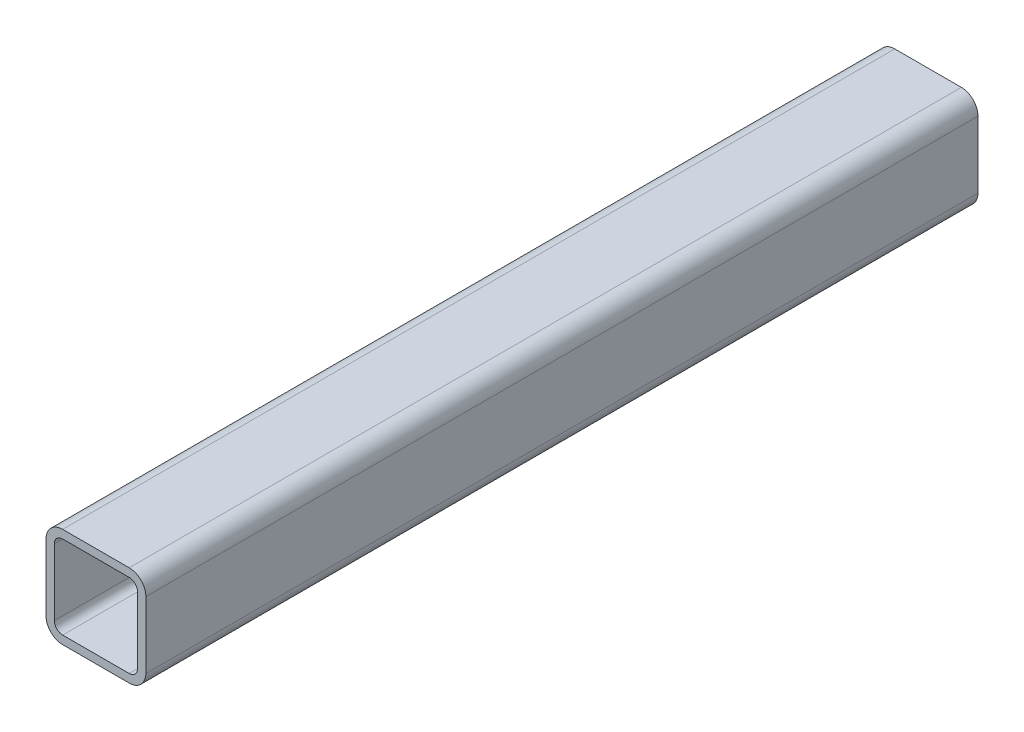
ISO-10303-21;
HEADER;
FILE_DESCRIPTION(('STEP AP214'),'2;1');
FILE_NAME('part.step','',(''),(''),'','','');
FILE_SCHEMA(('AUTOMOTIVE_DESIGN { 1 0 10303 214 1 1 1 1 }'));
ENDSEC;
DATA;
#1=APPLICATION_CONTEXT('core data for automotive mechanical design processes');
#2=APPLICATION_PROTOCOL_DEFINITION('international standard','automotive_design',2000,#1);
#3=PRODUCT_CONTEXT('',#1,'mechanical');
#4=PRODUCT('Part','Part','',(#3));
#5=PRODUCT_RELATED_PRODUCT_CATEGORY('part','',(#4));
#6=PRODUCT_DEFINITION_FORMATION('','',#4);
#7=PRODUCT_DEFINITION_CONTEXT('part definition',#1,'design');
#8=PRODUCT_DEFINITION('design','',#6,#7);
#9=PRODUCT_DEFINITION_SHAPE('','',#8);
#10=(LENGTH_UNIT() NAMED_UNIT(*) SI_UNIT(.MILLI.,.METRE.));
#11=(NAMED_UNIT(*) PLANE_ANGLE_UNIT() SI_UNIT($,.RADIAN.));
#12=(NAMED_UNIT(*) SI_UNIT($,.STERADIAN.) SOLID_ANGLE_UNIT());
#13=UNCERTAINTY_MEASURE_WITH_UNIT(LENGTH_MEASURE(1.E-05),#10,'distance_accuracy_value','');
#14=(GEOMETRIC_REPRESENTATION_CONTEXT(3) GLOBAL_UNCERTAINTY_ASSIGNED_CONTEXT((#13)) GLOBAL_UNIT_ASSIGNED_CONTEXT((#10,
#11,#12)) REPRESENTATION_CONTEXT('',''));
#15=CARTESIAN_POINT('',(0.,0.,0.));
#16=DIRECTION('',(0.,0.,1.));
#17=DIRECTION('',(1.,0.,0.));
#18=AXIS2_PLACEMENT_3D('',#15,#16,#17);
#19=CARTESIAN_POINT('',(-25.4,25.4,635.));
#20=DIRECTION('',(0.,0.,-1.));
#21=DIRECTION('',(-1.,0.,0.));
#22=AXIS2_PLACEMENT_3D('',#19,#20,#21);
#23=CYLINDRICAL_SURFACE('',#22,12.7);
#24=CARTESIAN_POINT('',(-25.4,25.4,0.));
#25=DIRECTION('',(0.,0.,-1.));
#26=DIRECTION('',(-1.,0.,0.));
#27=AXIS2_PLACEMENT_3D('',#24,#25,#26);
#28=CIRCLE('',#27,12.7);
#29=CARTESIAN_POINT('',(-38.1,25.4,0.));
#30=VERTEX_POINT('',#29);
#31=CARTESIAN_POINT('',(-25.4,38.1,0.));
#32=VERTEX_POINT('',#31);
#33=EDGE_CURVE('E199',#30,#32,#28,.T.);
#34=ORIENTED_EDGE('',*,*,#33,.F.);
#35=DIRECTION('',(0.,0.,-1.));
#36=VECTOR('',#35,1.);
#37=CARTESIAN_POINT('',(-38.1,25.4,635.));
#38=LINE('',#37,#36);
#39=CARTESIAN_POINT('',(-38.1,25.4,635.));
#40=VERTEX_POINT('',#39);
#41=EDGE_CURVE('E11',#40,#30,#38,.T.);
#42=ORIENTED_EDGE('',*,*,#41,.F.);
#43=CARTESIAN_POINT('',(-25.4,25.4,635.));
#44=DIRECTION('',(0.,0.,-1.));
#45=DIRECTION('',(-1.,0.,0.));
#46=AXIS2_PLACEMENT_3D('',#43,#44,#45);
#47=CIRCLE('',#46,12.7);
#48=CARTESIAN_POINT('',(-25.4,38.1,635.));
#49=VERTEX_POINT('',#48);
#50=EDGE_CURVE('E211',#40,#49,#47,.T.);
#51=ORIENTED_EDGE('',*,*,#50,.T.);
#52=DIRECTION('',(0.,0.,-1.));
#53=VECTOR('',#52,1.);
#54=CARTESIAN_POINT('',(-25.4,38.1,635.));
#55=LINE('',#54,#53);
#56=EDGE_CURVE('E35',#49,#32,#55,.T.);
#57=ORIENTED_EDGE('',*,*,#56,.T.);
#58=EDGE_LOOP('',(#34,#42,#51,#57));
#59=FACE_BOUND('',#58,.T.);
#60=ADVANCED_FACE('F32',(#59),#23,.T.);
#61=CARTESIAN_POINT('',(-38.1,25.4,635.));
#62=DIRECTION('',(1.,0.,0.));
#63=DIRECTION('',(0.,1.,0.));
#64=AXIS2_PLACEMENT_3D('',#61,#62,#63);
#65=PLANE('',#64);
#66=DIRECTION('',(0.,-1.,0.));
#67=VECTOR('',#66,1.);
#68=CARTESIAN_POINT('',(-38.1,25.4,0.));
#69=LINE('',#68,#67);
#70=CARTESIAN_POINT('',(-38.1,-25.4,0.));
#71=VERTEX_POINT('',#70);
#72=EDGE_CURVE('E215',#30,#71,#69,.T.);
#73=ORIENTED_EDGE('',*,*,#72,.T.);
#74=DIRECTION('',(0.,0.,-1.));
#75=VECTOR('',#74,1.);
#76=CARTESIAN_POINT('',(-38.1,-25.4,635.));
#77=LINE('',#76,#75);
#78=CARTESIAN_POINT('',(-38.1,-25.4,635.));
#79=VERTEX_POINT('',#78);
#80=EDGE_CURVE('E40',#79,#71,#77,.T.);
#81=ORIENTED_EDGE('',*,*,#80,.F.);
#82=DIRECTION('',(0.,-1.,0.));
#83=VECTOR('',#82,1.);
#84=CARTESIAN_POINT('',(-38.1,25.4,635.));
#85=LINE('',#84,#83);
#86=EDGE_CURVE('E231',#40,#79,#85,.T.);
#87=ORIENTED_EDGE('',*,*,#86,.F.);
#88=ORIENTED_EDGE('',*,*,#41,.T.);
#89=EDGE_LOOP('',(#73,#81,#87,#88));
#90=FACE_BOUND('',#89,.T.);
#91=ADVANCED_FACE('F279',(#90),#65,.F.);
#92=CARTESIAN_POINT('',(-25.4,-25.4,635.));
#93=DIRECTION('',(0.,0.,-1.));
#94=DIRECTION('',(-1.,0.,0.));
#95=AXIS2_PLACEMENT_3D('',#92,#93,#94);
#96=CYLINDRICAL_SURFACE('',#95,12.7);
#97=CARTESIAN_POINT('',(-25.4,-25.4,0.));
#98=DIRECTION('',(0.,0.,-1.));
#99=DIRECTION('',(-1.,0.,0.));
#100=AXIS2_PLACEMENT_3D('',#97,#98,#99);
#101=CIRCLE('',#100,12.7);
#102=CARTESIAN_POINT('',(-25.4,-38.1,0.));
#103=VERTEX_POINT('',#102);
#104=EDGE_CURVE('E249',#103,#71,#101,.T.);
#105=ORIENTED_EDGE('',*,*,#104,.F.);
#106=DIRECTION('',(0.,0.,-1.));
#107=VECTOR('',#106,1.);
#108=CARTESIAN_POINT('',(-25.4,-38.1,635.));
#109=LINE('',#108,#107);
#110=CARTESIAN_POINT('',(-25.4,-38.1,635.));
#111=VERTEX_POINT('',#110);
#112=EDGE_CURVE('E255',#111,#103,#109,.T.);
#113=ORIENTED_EDGE('',*,*,#112,.F.);
#114=CARTESIAN_POINT('',(-25.4,-25.4,635.));
#115=DIRECTION('',(0.,0.,-1.));
#116=DIRECTION('',(-1.,0.,0.));
#117=AXIS2_PLACEMENT_3D('',#114,#115,#116);
#118=CIRCLE('',#117,12.7);
#119=EDGE_CURVE('E228',#111,#79,#118,.T.);
#120=ORIENTED_EDGE('',*,*,#119,.T.);
#121=ORIENTED_EDGE('',*,*,#80,.T.);
#122=EDGE_LOOP('',(#105,#113,#120,#121));
#123=FACE_BOUND('',#122,.T.);
#124=ADVANCED_FACE('F298',(#123),#96,.T.);
#125=CARTESIAN_POINT('',(25.4,-38.1,635.));
#126=DIRECTION('',(0.,-1.,0.));
#127=DIRECTION('',(0.,0.,-1.));
#128=AXIS2_PLACEMENT_3D('',#125,#126,#127);
#129=PLANE('',#128);
#130=DIRECTION('',(-1.,0.,0.));
#131=VECTOR('',#130,1.);
#132=CARTESIAN_POINT('',(25.4,-38.1,0.));
#133=LINE('',#132,#131);
#134=CARTESIAN_POINT('',(25.4,-38.1,0.));
#135=VERTEX_POINT('',#134);
#136=EDGE_CURVE('E246',#135,#103,#133,.T.);
#137=ORIENTED_EDGE('',*,*,#136,.F.);
#138=DIRECTION('',(0.,0.,-1.));
#139=VECTOR('',#138,1.);
#140=CARTESIAN_POINT('',(25.4,-38.1,635.));
#141=LINE('',#140,#139);
#142=CARTESIAN_POINT('',(25.4,-38.1,635.));
#143=VERTEX_POINT('',#142);
#144=EDGE_CURVE('E257',#143,#135,#141,.T.);
#145=ORIENTED_EDGE('',*,*,#144,.F.);
#146=DIRECTION('',(-1.,0.,0.));
#147=VECTOR('',#146,1.);
#148=CARTESIAN_POINT('',(25.4,-38.1,635.));
#149=LINE('',#148,#147);
#150=EDGE_CURVE('E225',#143,#111,#149,.T.);
#151=ORIENTED_EDGE('',*,*,#150,.T.);
#152=ORIENTED_EDGE('',*,*,#112,.T.);
#153=EDGE_LOOP('',(#137,#145,#151,#152));
#154=FACE_BOUND('',#153,.T.);
#155=ADVANCED_FACE('F296',(#154),#129,.T.);
#156=CARTESIAN_POINT('',(25.4,-25.4,635.));
#157=DIRECTION('',(0.,0.,-1.));
#158=DIRECTION('',(-1.,0.,0.));
#159=AXIS2_PLACEMENT_3D('',#156,#157,#158);
#160=CYLINDRICAL_SURFACE('',#159,12.7);
#161=CARTESIAN_POINT('',(25.4,-25.4,0.));
#162=DIRECTION('',(0.,0.,-1.));
#163=DIRECTION('',(-1.,0.,0.));
#164=AXIS2_PLACEMENT_3D('',#161,#162,#163);
#165=CIRCLE('',#164,12.7);
#166=CARTESIAN_POINT('',(38.1,-25.4,0.));
#167=VERTEX_POINT('',#166);
#168=EDGE_CURVE('E243',#167,#135,#165,.T.);
#169=ORIENTED_EDGE('',*,*,#168,.F.);
#170=DIRECTION('',(0.,0.,-1.));
#171=VECTOR('',#170,1.);
#172=CARTESIAN_POINT('',(38.1,-25.4,635.));
#173=LINE('',#172,#171);
#174=CARTESIAN_POINT('',(38.1,-25.4,635.));
#175=VERTEX_POINT('',#174);
#176=EDGE_CURVE('E259',#175,#167,#173,.T.);
#177=ORIENTED_EDGE('',*,*,#176,.F.);
#178=CARTESIAN_POINT('',(25.4,-25.4,635.));
#179=DIRECTION('',(0.,0.,-1.));
#180=DIRECTION('',(-1.,0.,0.));
#181=AXIS2_PLACEMENT_3D('',#178,#179,#180);
#182=CIRCLE('',#181,12.7);
#183=EDGE_CURVE('E222',#175,#143,#182,.T.);
#184=ORIENTED_EDGE('',*,*,#183,.T.);
#185=ORIENTED_EDGE('',*,*,#144,.T.);
#186=EDGE_LOOP('',(#169,#177,#184,#185));
#187=FACE_BOUND('',#186,.T.);
#188=ADVANCED_FACE('F292',(#187),#160,.T.);
#189=CARTESIAN_POINT('',(38.1,-25.4,635.));
#190=DIRECTION('',(-1.,0.,0.));
#191=DIRECTION('',(0.,0.,1.));
#192=AXIS2_PLACEMENT_3D('',#189,#190,#191);
#193=PLANE('',#192);
#194=DIRECTION('',(0.,1.,0.));
#195=VECTOR('',#194,1.);
#196=CARTESIAN_POINT('',(38.1,-25.4,0.));
#197=LINE('',#196,#195);
#198=CARTESIAN_POINT('',(38.1,25.4,0.));
#199=VERTEX_POINT('',#198);
#200=EDGE_CURVE('E241',#167,#199,#197,.T.);
#201=ORIENTED_EDGE('',*,*,#200,.T.);
#202=DIRECTION('',(0.,0.,-1.));
#203=VECTOR('',#202,1.);
#204=CARTESIAN_POINT('',(38.1,25.4,635.));
#205=LINE('',#204,#203);
#206=CARTESIAN_POINT('',(38.1,25.4,635.));
#207=VERTEX_POINT('',#206);
#208=EDGE_CURVE('E261',#207,#199,#205,.T.);
#209=ORIENTED_EDGE('',*,*,#208,.F.);
#210=DIRECTION('',(0.,1.,0.));
#211=VECTOR('',#210,1.);
#212=CARTESIAN_POINT('',(38.1,-25.4,635.));
#213=LINE('',#212,#211);
#214=EDGE_CURVE('E220',#175,#207,#213,.T.);
#215=ORIENTED_EDGE('',*,*,#214,.F.);
#216=ORIENTED_EDGE('',*,*,#176,.T.);
#217=EDGE_LOOP('',(#201,#209,#215,#216));
#218=FACE_BOUND('',#217,.T.);
#219=ADVANCED_FACE('F333',(#218),#193,.F.);
#220=CARTESIAN_POINT('',(25.4,25.4,635.));
#221=DIRECTION('',(0.,0.,-1.));
#222=DIRECTION('',(-1.,0.,0.));
#223=AXIS2_PLACEMENT_3D('',#220,#221,#222);
#224=CYLINDRICAL_SURFACE('',#223,12.7);
#225=CARTESIAN_POINT('',(25.4,25.4,0.));
#226=DIRECTION('',(0.,0.,1.));
#227=DIRECTION('',(1.,0.,0.));
#228=AXIS2_PLACEMENT_3D('',#225,#226,#227);
#229=CIRCLE('',#228,12.7);
#230=CARTESIAN_POINT('',(25.4,38.1,0.));
#231=VERTEX_POINT('',#230);
#232=EDGE_CURVE('E238',#199,#231,#229,.T.);
#233=ORIENTED_EDGE('',*,*,#232,.T.);
#234=DIRECTION('',(0.,0.,-1.));
#235=VECTOR('',#234,1.);
#236=CARTESIAN_POINT('',(25.4,38.1,635.));
#237=LINE('',#236,#235);
#238=CARTESIAN_POINT('',(25.4,38.1,635.));
#239=VERTEX_POINT('',#238);
#240=EDGE_CURVE('E263',#239,#231,#237,.T.);
#241=ORIENTED_EDGE('',*,*,#240,.F.);
#242=CARTESIAN_POINT('',(25.4,25.4,635.));
#243=DIRECTION('',(0.,0.,1.));
#244=DIRECTION('',(1.,0.,0.));
#245=AXIS2_PLACEMENT_3D('',#242,#243,#244);
#246=CIRCLE('',#245,12.7);
#247=EDGE_CURVE('E218',#207,#239,#246,.T.);
#248=ORIENTED_EDGE('',*,*,#247,.F.);
#249=ORIENTED_EDGE('',*,*,#208,.T.);
#250=EDGE_LOOP('',(#233,#241,#248,#249));
#251=FACE_BOUND('',#250,.T.);
#252=ADVANCED_FACE('F287',(#251),#224,.T.);
#253=CARTESIAN_POINT('',(-25.4,38.1,635.));
#254=DIRECTION('',(0.,1.,0.));
#255=DIRECTION('',(0.,0.,1.));
#256=AXIS2_PLACEMENT_3D('',#253,#254,#255);
#257=PLANE('',#256);
#258=DIRECTION('',(1.,0.,0.));
#259=VECTOR('',#258,1.);
#260=CARTESIAN_POINT('',(-25.4,38.1,0.));
#261=LINE('',#260,#259);
#262=EDGE_CURVE('E235',#32,#231,#261,.T.);
#263=ORIENTED_EDGE('',*,*,#262,.F.);
#264=ORIENTED_EDGE('',*,*,#56,.F.);
#265=DIRECTION('',(1.,0.,0.));
#266=VECTOR('',#265,1.);
#267=CARTESIAN_POINT('',(-25.4,38.1,635.));
#268=LINE('',#267,#266);
#269=EDGE_CURVE('E214',#49,#239,#268,.T.);
#270=ORIENTED_EDGE('',*,*,#269,.T.);
#271=ORIENTED_EDGE('',*,*,#240,.T.);
#272=EDGE_LOOP('',(#263,#264,#270,#271));
#273=FACE_BOUND('',#272,.T.);
#274=ADVANCED_FACE('F271',(#273),#257,.T.);
#275=CARTESIAN_POINT('',(-25.4,25.4,635.));
#276=DIRECTION('',(0.,0.,-1.));
#277=DIRECTION('',(-1.,0.,0.));
#278=AXIS2_PLACEMENT_3D('',#275,#276,#277);
#279=PLANE('',#278);
#280=DIRECTION('',(0.,-1.,0.));
#281=VECTOR('',#280,1.);
#282=CARTESIAN_POINT('',(-31.75,25.4,635.));
#283=LINE('',#282,#281);
#284=CARTESIAN_POINT('',(-31.75,25.4,635.));
#285=VERTEX_POINT('',#284);
#286=CARTESIAN_POINT('',(-31.75,-25.4,635.));
#287=VERTEX_POINT('',#286);
#288=EDGE_CURVE('E150',#285,#287,#283,.T.);
#289=ORIENTED_EDGE('',*,*,#288,.F.);
#290=CARTESIAN_POINT('',(-25.4,25.4,635.));
#291=DIRECTION('',(0.,0.,-1.));
#292=DIRECTION('',(-1.,0.,0.));
#293=AXIS2_PLACEMENT_3D('',#290,#291,#292);
#294=CIRCLE('',#293,6.35);
#295=CARTESIAN_POINT('',(-25.4,31.75,635.));
#296=VERTEX_POINT('',#295);
#297=EDGE_CURVE('E147',#285,#296,#294,.T.);
#298=ORIENTED_EDGE('',*,*,#297,.T.);
#299=DIRECTION('',(1.,0.,0.));
#300=VECTOR('',#299,1.);
#301=CARTESIAN_POINT('',(-25.4,31.75,635.));
#302=LINE('',#301,#300);
#303=CARTESIAN_POINT('',(25.4,31.75,635.));
#304=VERTEX_POINT('',#303);
#305=EDGE_CURVE('E153',#296,#304,#302,.T.);
#306=ORIENTED_EDGE('',*,*,#305,.T.);
#307=CARTESIAN_POINT('',(25.4,25.4,635.));
#308=DIRECTION('',(0.,0.,-1.));
#309=DIRECTION('',(-1.,0.,0.));
#310=AXIS2_PLACEMENT_3D('',#307,#308,#309);
#311=CIRCLE('',#310,6.35000000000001);
#312=CARTESIAN_POINT('',(31.75,25.4,635.));
#313=VERTEX_POINT('',#312);
#314=EDGE_CURVE('E157',#313,#304,#311,.F.);
#315=ORIENTED_EDGE('',*,*,#314,.F.);
#316=DIRECTION('',(0.,1.,0.));
#317=VECTOR('',#316,1.);
#318=CARTESIAN_POINT('',(31.75,25.4,635.));
#319=LINE('',#318,#317);
#320=CARTESIAN_POINT('',(31.75,-25.4,635.));
#321=VERTEX_POINT('',#320);
#322=EDGE_CURVE('E169',#321,#313,#319,.T.);
#323=ORIENTED_EDGE('',*,*,#322,.F.);
#324=CARTESIAN_POINT('',(25.4,-25.4,635.));
#325=DIRECTION('',(0.,0.,-1.));
#326=DIRECTION('',(-1.,0.,0.));
#327=AXIS2_PLACEMENT_3D('',#324,#325,#326);
#328=CIRCLE('',#327,6.35);
#329=CARTESIAN_POINT('',(25.4,-31.75,635.));
#330=VERTEX_POINT('',#329);
#331=EDGE_CURVE('E171',#321,#330,#328,.T.);
#332=ORIENTED_EDGE('',*,*,#331,.T.);
#333=DIRECTION('',(-1.,0.,0.));
#334=VECTOR('',#333,1.);
#335=CARTESIAN_POINT('',(-25.4,-31.75,635.));
#336=LINE('',#335,#334);
#337=CARTESIAN_POINT('',(-25.4,-31.75,635.));
#338=VERTEX_POINT('',#337);
#339=EDGE_CURVE('E174',#330,#338,#336,.T.);
#340=ORIENTED_EDGE('',*,*,#339,.T.);
#341=CARTESIAN_POINT('',(-25.4,-25.4,635.));
#342=DIRECTION('',(0.,0.,-1.));
#343=DIRECTION('',(-1.,0.,0.));
#344=AXIS2_PLACEMENT_3D('',#341,#342,#343);
#345=CIRCLE('',#344,6.35000000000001);
#346=EDGE_CURVE('E177',#338,#287,#345,.T.);
#347=ORIENTED_EDGE('',*,*,#346,.T.);
#348=EDGE_LOOP('',(#289,#298,#306,#315,#323,#332,#340,#347));
#349=FACE_BOUND('',#348,.T.);
#350=ORIENTED_EDGE('',*,*,#50,.F.);
#351=ORIENTED_EDGE('',*,*,#86,.T.);
#352=ORIENTED_EDGE('',*,*,#119,.F.);
#353=ORIENTED_EDGE('',*,*,#150,.F.);
#354=ORIENTED_EDGE('',*,*,#183,.F.);
#355=ORIENTED_EDGE('',*,*,#214,.T.);
#356=ORIENTED_EDGE('',*,*,#247,.T.);
#357=ORIENTED_EDGE('',*,*,#269,.F.);
#358=EDGE_LOOP('',(#350,#351,#352,#353,#354,#355,#356,#357));
#359=FACE_BOUND('',#358,.T.);
#360=ADVANCED_FACE('F159',(#349,#359),#279,.F.);
#361=CARTESIAN_POINT('',(-25.4,25.4,0.));
#362=DIRECTION('',(0.,0.,-1.));
#363=DIRECTION('',(-1.,0.,0.));
#364=AXIS2_PLACEMENT_3D('',#361,#362,#363);
#365=PLANE('',#364);
#366=CARTESIAN_POINT('',(-25.4,25.4,0.));
#367=DIRECTION('',(0.,0.,-1.));
#368=DIRECTION('',(-1.,0.,0.));
#369=AXIS2_PLACEMENT_3D('',#366,#367,#368);
#370=CIRCLE('',#369,6.35);
#371=CARTESIAN_POINT('',(-31.75,25.4,0.));
#372=VERTEX_POINT('',#371);
#373=CARTESIAN_POINT('',(-25.4,31.75,0.));
#374=VERTEX_POINT('',#373);
#375=EDGE_CURVE('E56',#372,#374,#370,.T.);
#376=ORIENTED_EDGE('',*,*,#375,.F.);
#377=DIRECTION('',(0.,-1.,0.));
#378=VECTOR('',#377,1.);
#379=CARTESIAN_POINT('',(-31.75,25.4,0.));
#380=LINE('',#379,#378);
#381=CARTESIAN_POINT('',(-31.75,-25.4,0.));
#382=VERTEX_POINT('',#381);
#383=EDGE_CURVE('E162',#372,#382,#380,.T.);
#384=ORIENTED_EDGE('',*,*,#383,.T.);
#385=CARTESIAN_POINT('',(-25.4,-25.4,0.));
#386=DIRECTION('',(0.,0.,-1.));
#387=DIRECTION('',(-1.,0.,0.));
#388=AXIS2_PLACEMENT_3D('',#385,#386,#387);
#389=CIRCLE('',#388,6.35000000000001);
#390=CARTESIAN_POINT('',(-25.4,-31.75,0.));
#391=VERTEX_POINT('',#390);
#392=EDGE_CURVE('E165',#391,#382,#389,.T.);
#393=ORIENTED_EDGE('',*,*,#392,.F.);
#394=DIRECTION('',(-1.,0.,0.));
#395=VECTOR('',#394,1.);
#396=CARTESIAN_POINT('',(-25.4,-31.75,0.));
#397=LINE('',#396,#395);
#398=CARTESIAN_POINT('',(25.4,-31.75,0.));
#399=VERTEX_POINT('',#398);
#400=EDGE_CURVE('E192',#399,#391,#397,.T.);
#401=ORIENTED_EDGE('',*,*,#400,.F.);
#402=CARTESIAN_POINT('',(25.4,-25.4,0.));
#403=DIRECTION('',(0.,0.,-1.));
#404=DIRECTION('',(-1.,0.,0.));
#405=AXIS2_PLACEMENT_3D('',#402,#403,#404);
#406=CIRCLE('',#405,6.35);
#407=CARTESIAN_POINT('',(31.75,-25.4,0.));
#408=VERTEX_POINT('',#407);
#409=EDGE_CURVE('E189',#408,#399,#406,.T.);
#410=ORIENTED_EDGE('',*,*,#409,.F.);
#411=DIRECTION('',(0.,1.,0.));
#412=VECTOR('',#411,1.);
#413=CARTESIAN_POINT('',(31.75,25.4,0.));
#414=LINE('',#413,#412);
#415=CARTESIAN_POINT('',(31.75,25.4,0.));
#416=VERTEX_POINT('',#415);
#417=EDGE_CURVE('E186',#408,#416,#414,.T.);
#418=ORIENTED_EDGE('',*,*,#417,.T.);
#419=CARTESIAN_POINT('',(25.4,25.4,0.));
#420=DIRECTION('',(0.,0.,-1.));
#421=DIRECTION('',(-1.,0.,0.));
#422=AXIS2_PLACEMENT_3D('',#419,#420,#421);
#423=CIRCLE('',#422,6.35000000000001);
#424=CARTESIAN_POINT('',(25.4,31.75,0.));
#425=VERTEX_POINT('',#424);
#426=EDGE_CURVE('E183',#416,#425,#423,.F.);
#427=ORIENTED_EDGE('',*,*,#426,.T.);
#428=DIRECTION('',(1.,0.,0.));
#429=VECTOR('',#428,1.);
#430=CARTESIAN_POINT('',(-25.4,31.75,0.));
#431=LINE('',#430,#429);
#432=EDGE_CURVE('E181',#374,#425,#431,.T.);
#433=ORIENTED_EDGE('',*,*,#432,.F.);
#434=EDGE_LOOP('',(#376,#384,#393,#401,#410,#418,#427,#433));
#435=FACE_BOUND('',#434,.T.);
#436=ORIENTED_EDGE('',*,*,#33,.T.);
#437=ORIENTED_EDGE('',*,*,#262,.T.);
#438=ORIENTED_EDGE('',*,*,#232,.F.);
#439=ORIENTED_EDGE('',*,*,#200,.F.);
#440=ORIENTED_EDGE('',*,*,#168,.T.);
#441=ORIENTED_EDGE('',*,*,#136,.T.);
#442=ORIENTED_EDGE('',*,*,#104,.T.);
#443=ORIENTED_EDGE('',*,*,#72,.F.);
#444=EDGE_LOOP('',(#436,#437,#438,#439,#440,#441,#442,#443));
#445=FACE_BOUND('',#444,.T.);
#446=ADVANCED_FACE('F275',(#435,#445),#365,.T.);
#447=CARTESIAN_POINT('',(-25.4,25.4,635.));
#448=DIRECTION('',(0.,0.,-1.));
#449=DIRECTION('',(-1.,0.,0.));
#450=AXIS2_PLACEMENT_3D('',#447,#448,#449);
#451=CYLINDRICAL_SURFACE('',#450,6.35);
#452=ORIENTED_EDGE('',*,*,#375,.T.);
#453=DIRECTION('',(0.,0.,-1.));
#454=VECTOR('',#453,1.);
#455=CARTESIAN_POINT('',(-25.4,31.75,635.));
#456=LINE('',#455,#454);
#457=EDGE_CURVE('E144',#296,#374,#456,.T.);
#458=ORIENTED_EDGE('',*,*,#457,.F.);
#459=ORIENTED_EDGE('',*,*,#297,.F.);
#460=DIRECTION('',(0.,0.,-1.));
#461=VECTOR('',#460,1.);
#462=CARTESIAN_POINT('',(-31.75,25.4,635.));
#463=LINE('',#462,#461);
#464=EDGE_CURVE('E197',#285,#372,#463,.T.);
#465=ORIENTED_EDGE('',*,*,#464,.T.);
#466=EDGE_LOOP('',(#452,#458,#459,#465));
#467=FACE_BOUND('',#466,.T.);
#468=ADVANCED_FACE('F145',(#467),#451,.F.);
#469=CARTESIAN_POINT('',(-31.75,25.4,635.));
#470=DIRECTION('',(1.,0.,0.));
#471=DIRECTION('',(0.,1.,0.));
#472=AXIS2_PLACEMENT_3D('',#469,#470,#471);
#473=PLANE('',#472);
#474=ORIENTED_EDGE('',*,*,#383,.F.);
#475=ORIENTED_EDGE('',*,*,#464,.F.);
#476=ORIENTED_EDGE('',*,*,#288,.T.);
#477=DIRECTION('',(0.,0.,-1.));
#478=VECTOR('',#477,1.);
#479=CARTESIAN_POINT('',(-31.75,-25.4,635.));
#480=LINE('',#479,#478);
#481=EDGE_CURVE('E200',#287,#382,#480,.T.);
#482=ORIENTED_EDGE('',*,*,#481,.T.);
#483=EDGE_LOOP('',(#474,#475,#476,#482));
#484=FACE_BOUND('',#483,.T.);
#485=ADVANCED_FACE('F382',(#484),#473,.T.);
#486=CARTESIAN_POINT('',(-25.4,-25.4,635.));
#487=DIRECTION('',(0.,0.,-1.));
#488=DIRECTION('',(-1.,0.,0.));
#489=AXIS2_PLACEMENT_3D('',#486,#487,#488);
#490=CYLINDRICAL_SURFACE('',#489,6.35000000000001);
#491=ORIENTED_EDGE('',*,*,#392,.T.);
#492=ORIENTED_EDGE('',*,*,#481,.F.);
#493=ORIENTED_EDGE('',*,*,#346,.F.);
#494=DIRECTION('',(0.,0.,-1.));
#495=VECTOR('',#494,1.);
#496=CARTESIAN_POINT('',(-25.4,-31.75,635.));
#497=LINE('',#496,#495);
#498=EDGE_CURVE('E202',#338,#391,#497,.T.);
#499=ORIENTED_EDGE('',*,*,#498,.T.);
#500=EDGE_LOOP('',(#491,#492,#493,#499));
#501=FACE_BOUND('',#500,.T.);
#502=ADVANCED_FACE('F391',(#501),#490,.F.);
#503=CARTESIAN_POINT('',(-25.4,-31.75,635.));
#504=DIRECTION('',(0.,-1.,0.));
#505=DIRECTION('',(0.,0.,-1.));
#506=AXIS2_PLACEMENT_3D('',#503,#504,#505);
#507=PLANE('',#506);
#508=ORIENTED_EDGE('',*,*,#400,.T.);
#509=ORIENTED_EDGE('',*,*,#498,.F.);
#510=ORIENTED_EDGE('',*,*,#339,.F.);
#511=DIRECTION('',(0.,0.,-1.));
#512=VECTOR('',#511,1.);
#513=CARTESIAN_POINT('',(25.4,-31.75,635.));
#514=LINE('',#513,#512);
#515=EDGE_CURVE('E204',#330,#399,#514,.T.);
#516=ORIENTED_EDGE('',*,*,#515,.T.);
#517=EDGE_LOOP('',(#508,#509,#510,#516));
#518=FACE_BOUND('',#517,.T.);
#519=ADVANCED_FACE('F401',(#518),#507,.F.);
#520=CARTESIAN_POINT('',(25.4,-25.4,635.));
#521=DIRECTION('',(0.,0.,-1.));
#522=DIRECTION('',(-1.,0.,0.));
#523=AXIS2_PLACEMENT_3D('',#520,#521,#522);
#524=CYLINDRICAL_SURFACE('',#523,6.35);
#525=ORIENTED_EDGE('',*,*,#409,.T.);
#526=ORIENTED_EDGE('',*,*,#515,.F.);
#527=ORIENTED_EDGE('',*,*,#331,.F.);
#528=DIRECTION('',(0.,0.,-1.));
#529=VECTOR('',#528,1.);
#530=CARTESIAN_POINT('',(31.75,-25.4,635.));
#531=LINE('',#530,#529);
#532=EDGE_CURVE('E206',#321,#408,#531,.T.);
#533=ORIENTED_EDGE('',*,*,#532,.T.);
#534=EDGE_LOOP('',(#525,#526,#527,#533));
#535=FACE_BOUND('',#534,.T.);
#536=ADVANCED_FACE('F411',(#535),#524,.F.);
#537=CARTESIAN_POINT('',(31.75,25.4,635.));
#538=DIRECTION('',(-1.,0.,0.));
#539=DIRECTION('',(0.,0.,1.));
#540=AXIS2_PLACEMENT_3D('',#537,#538,#539);
#541=PLANE('',#540);
#542=ORIENTED_EDGE('',*,*,#417,.F.);
#543=ORIENTED_EDGE('',*,*,#532,.F.);
#544=ORIENTED_EDGE('',*,*,#322,.T.);
#545=DIRECTION('',(0.,0.,-1.));
#546=VECTOR('',#545,1.);
#547=CARTESIAN_POINT('',(31.75,25.4,635.));
#548=LINE('',#547,#546);
#549=EDGE_CURVE('E208',#313,#416,#548,.T.);
#550=ORIENTED_EDGE('',*,*,#549,.T.);
#551=EDGE_LOOP('',(#542,#543,#544,#550));
#552=FACE_BOUND('',#551,.T.);
#553=ADVANCED_FACE('F421',(#552),#541,.T.);
#554=CARTESIAN_POINT('',(25.4,25.4,635.));
#555=DIRECTION('',(0.,0.,-1.));
#556=DIRECTION('',(-1.,0.,0.));
#557=AXIS2_PLACEMENT_3D('',#554,#555,#556);
#558=CYLINDRICAL_SURFACE('',#557,6.35000000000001);
#559=ORIENTED_EDGE('',*,*,#426,.F.);
#560=ORIENTED_EDGE('',*,*,#549,.F.);
#561=ORIENTED_EDGE('',*,*,#314,.T.);
#562=DIRECTION('',(0.,0.,-1.));
#563=VECTOR('',#562,1.);
#564=CARTESIAN_POINT('',(25.4,31.75,635.));
#565=LINE('',#564,#563);
#566=EDGE_CURVE('E48',#304,#425,#565,.T.);
#567=ORIENTED_EDGE('',*,*,#566,.T.);
#568=EDGE_LOOP('',(#559,#560,#561,#567));
#569=FACE_BOUND('',#568,.T.);
#570=ADVANCED_FACE('F431',(#569),#558,.F.);
#571=CARTESIAN_POINT('',(-25.4,31.75,635.));
#572=DIRECTION('',(0.,1.,0.));
#573=DIRECTION('',(0.,0.,1.));
#574=AXIS2_PLACEMENT_3D('',#571,#572,#573);
#575=PLANE('',#574);
#576=ORIENTED_EDGE('',*,*,#432,.T.);
#577=ORIENTED_EDGE('',*,*,#566,.F.);
#578=ORIENTED_EDGE('',*,*,#305,.F.);
#579=ORIENTED_EDGE('',*,*,#457,.T.);
#580=EDGE_LOOP('',(#576,#577,#578,#579));
#581=FACE_BOUND('',#580,.T.);
#582=ADVANCED_FACE('F154',(#581),#575,.F.);
#583=CLOSED_SHELL('',(#60,#91,#124,#155,#188,#219,#252,#274,#360,#446,#468,#485,#502,#519,#536,
#553,#570,#582));
#584=MANIFOLD_SOLID_BREP('B2',#583);
#585=ADVANCED_BREP_SHAPE_REPRESENTATION('',(#18,#584),#14);
#586=SHAPE_DEFINITION_REPRESENTATION(#9,#585);
ENDSEC;
END-ISO-10303-21;
